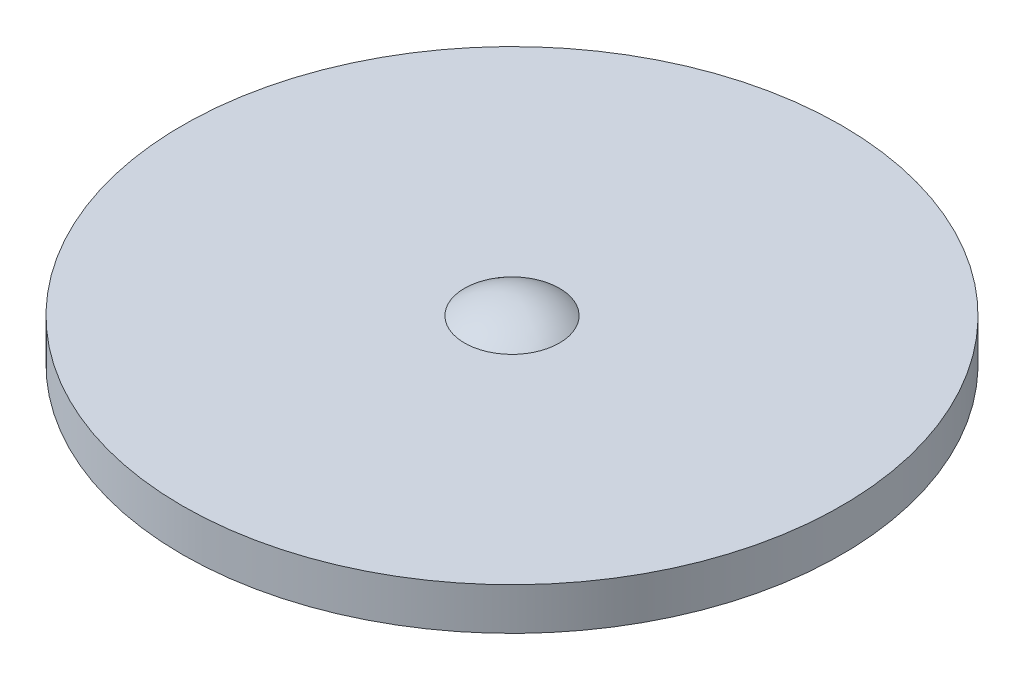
ISO-10303-21;
HEADER;
FILE_DESCRIPTION(('STEP AP214'),'2;1');
FILE_NAME('part.step','',(''),(''),'','','');
FILE_SCHEMA(('AUTOMOTIVE_DESIGN { 1 0 10303 214 1 1 1 1 }'));
ENDSEC;
DATA;
#1=APPLICATION_CONTEXT('core data for automotive mechanical design processes');
#2=APPLICATION_PROTOCOL_DEFINITION('international standard','automotive_design',2000,#1);
#3=PRODUCT_CONTEXT('',#1,'mechanical');
#4=PRODUCT('Part','Part','',(#3));
#5=PRODUCT_RELATED_PRODUCT_CATEGORY('part','',(#4));
#6=PRODUCT_DEFINITION_FORMATION('','',#4);
#7=PRODUCT_DEFINITION_CONTEXT('part definition',#1,'design');
#8=PRODUCT_DEFINITION('design','',#6,#7);
#9=PRODUCT_DEFINITION_SHAPE('','',#8);
#10=(LENGTH_UNIT() NAMED_UNIT(*) SI_UNIT(.MILLI.,.METRE.));
#11=(NAMED_UNIT(*) PLANE_ANGLE_UNIT() SI_UNIT($,.RADIAN.));
#12=(NAMED_UNIT(*) SI_UNIT($,.STERADIAN.) SOLID_ANGLE_UNIT());
#13=UNCERTAINTY_MEASURE_WITH_UNIT(LENGTH_MEASURE(1.E-05),#10,'distance_accuracy_value','');
#14=(GEOMETRIC_REPRESENTATION_CONTEXT(3) GLOBAL_UNCERTAINTY_ASSIGNED_CONTEXT((#13)) GLOBAL_UNIT_ASSIGNED_CONTEXT((#10,
#11,#12)) REPRESENTATION_CONTEXT('',''));
#15=CARTESIAN_POINT('',(0.,0.,0.));
#16=DIRECTION('',(0.,0.,1.));
#17=DIRECTION('',(1.,0.,0.));
#18=AXIS2_PLACEMENT_3D('',#15,#16,#17);
#19=CARTESIAN_POINT('',(0.,-3.048,0.));
#20=DIRECTION('',(-1.,0.,0.));
#21=DIRECTION('',(0.,-1.,0.));
#22=AXIS2_PLACEMENT_3D('',#19,#20,#21);
#23=SPHERICAL_SURFACE('',#22,3.81);
#24=CARTESIAN_POINT('',(-2.286,0.,0.));
#25=CARTESIAN_POINT('',(-2.28599961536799,0.,0.0641837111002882));
#26=CARTESIAN_POINT('',(-2.28329446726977,0.,0.128379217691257));
#27=CARTESIAN_POINT('',(-2.27249146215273,0.,0.256326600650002));
#28=CARTESIAN_POINT('',(-2.26439201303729,0.,0.320078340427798));
#29=CARTESIAN_POINT('',(-2.24283684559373,0.,0.446780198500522));
#30=CARTESIAN_POINT('',(-2.22937262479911,3.36263498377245E-13,0.509728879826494));
#31=CARTESIAN_POINT('',(-2.19718072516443,-3.3653694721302E-13,0.634303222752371));
#32=CARTESIAN_POINT('',(-2.17844877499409,-1.25661374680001E-12,0.695927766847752));
#33=CARTESIAN_POINT('',(-2.11461030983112,-2.25740404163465E-12,0.877891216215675));
#34=CARTESIAN_POINT('',(-2.06180874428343,-5.9142946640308E-13,0.995626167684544));
#35=CARTESIAN_POINT('',(-1.93716104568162,5.9145195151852E-13,1.22054725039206));
#36=CARTESIAN_POINT('',(-1.86531418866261,1.08277087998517E-13,1.32773298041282));
#37=CARTESIAN_POINT('',(-1.74489560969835,0.,1.47827088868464));
#38=CARTESIAN_POINT('',(-1.70261624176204,0.,1.52677176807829));
#39=CARTESIAN_POINT('',(-1.61415533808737,0.,1.62000599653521));
#40=CARTESIAN_POINT('',(-1.56797760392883,0.,1.6647429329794));
#41=CARTESIAN_POINT('',(-1.4719954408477,0.,1.75018721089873));
#42=CARTESIAN_POINT('',(-1.42218937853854,0.,1.79089271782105));
#43=CARTESIAN_POINT('',(-1.31932972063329,0.,1.86796735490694));
#44=CARTESIAN_POINT('',(-1.26627537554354,0.,1.904335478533));
#45=CARTESIAN_POINT('',(-1.10281841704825,0.,2.00650360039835));
#46=CARTESIAN_POINT('',(-0.988020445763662,0.,2.06545748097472));
#47=CARTESIAN_POINT('',(-0.750218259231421,0.,2.16321964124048));
#48=CARTESIAN_POINT('',(-0.627214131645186,-1.39268676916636E-13,2.202028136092));
#49=CARTESIAN_POINT('',(-0.376420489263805,-1.29613436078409E-13,2.25845407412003));
#50=CARTESIAN_POINT('',(-0.248630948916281,0.,2.27607140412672));
#51=CARTESIAN_POINT('',(0.00809187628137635,0.,2.28959666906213));
#52=CARTESIAN_POINT('',(0.13702516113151,0.,2.28550460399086));
#53=CARTESIAN_POINT('',(0.392359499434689,0.,2.25574366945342));
#54=CARTESIAN_POINT('',(0.518760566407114,0.,2.23007491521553));
#55=CARTESIAN_POINT('',(0.765518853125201,0.,2.15784148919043));
#56=CARTESIAN_POINT('',(0.885876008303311,0.,2.111276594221));
#57=CARTESIAN_POINT('',(1.05916360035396,0.,2.02684962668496));
#58=CARTESIAN_POINT('',(1.11574569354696,0.,1.99625762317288));
#59=CARTESIAN_POINT('',(1.22613469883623,0.,1.93041784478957));
#60=CARTESIAN_POINT('',(1.27994225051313,0.,1.89517114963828));
#61=CARTESIAN_POINT('',(1.38437129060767,0.,1.82028539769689));
#62=CARTESIAN_POINT('',(1.43499421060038,0.,1.780648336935));
#63=CARTESIAN_POINT('',(1.53276217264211,0.,1.69722544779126));
#64=CARTESIAN_POINT('',(1.57990381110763,0.,1.65343565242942));
#65=CARTESIAN_POINT('',(1.71547383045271,-1.15217019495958E-13,1.51638432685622));
#66=CARTESIAN_POINT('',(1.79818570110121,0.,1.41734141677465));
#67=CARTESIAN_POINT('',(1.94577738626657,0.,1.20676307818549));
#68=CARTESIAN_POINT('',(2.01065787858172,0.,1.09522812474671));
#69=CARTESIAN_POINT('',(2.09326310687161,0.,0.920979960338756));
#70=CARTESIAN_POINT('',(2.11836667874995,0.,0.861664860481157));
#71=CARTESIAN_POINT('',(2.16347026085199,0.,0.741162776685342));
#72=CARTESIAN_POINT('',(2.18347440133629,0.,0.679977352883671));
#73=CARTESIAN_POINT('',(2.21822368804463,0.,0.556241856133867));
#74=CARTESIAN_POINT('',(2.23297713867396,0.,0.493694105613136));
#75=CARTESIAN_POINT('',(2.25716466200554,0.,0.367590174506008));
#76=CARTESIAN_POINT('',(2.26660030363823,0.,0.304034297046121));
#77=CARTESIAN_POINT('',(2.27755994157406,0.,0.200316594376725));
#78=CARTESIAN_POINT('',(2.28072396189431,0.,0.160320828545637));
#79=CARTESIAN_POINT('',(2.28494411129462,0.,0.0802182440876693));
#80=CARTESIAN_POINT('',(2.28600024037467,0.,0.0401114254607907));
#81=CARTESIAN_POINT('',(2.28599961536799,0.,-0.0641837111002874));
#82=CARTESIAN_POINT('',(2.28329446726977,0.,-0.128379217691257));
#83=CARTESIAN_POINT('',(2.27249146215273,0.,-0.256326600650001));
#84=CARTESIAN_POINT('',(2.26439201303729,0.,-0.320078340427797));
#85=CARTESIAN_POINT('',(2.24283684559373,0.,-0.446780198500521));
#86=CARTESIAN_POINT('',(2.22937262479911,3.3628699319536E-13,-0.509728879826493));
#87=CARTESIAN_POINT('',(2.19718072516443,-3.36560461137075E-13,-0.63430322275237));
#88=CARTESIAN_POINT('',(2.17844877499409,-1.25662193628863E-12,-0.695927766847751));
#89=CARTESIAN_POINT('',(2.11461030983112,-2.25738770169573E-12,-0.877891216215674));
#90=CARTESIAN_POINT('',(2.06180874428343,-5.91425190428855E-13,-0.995626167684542));
#91=CARTESIAN_POINT('',(1.93716104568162,5.91447675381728E-13,-1.22054725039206));
#92=CARTESIAN_POINT('',(1.86531418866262,1.08276324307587E-13,-1.32773298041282));
#93=CARTESIAN_POINT('',(1.74489560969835,0.,-1.47827088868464));
#94=CARTESIAN_POINT('',(1.70261624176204,0.,-1.52677176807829));
#95=CARTESIAN_POINT('',(1.61415533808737,0.,-1.62000599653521));
#96=CARTESIAN_POINT('',(1.56797760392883,0.,-1.6647429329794));
#97=CARTESIAN_POINT('',(1.4719954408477,0.,-1.75018721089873));
#98=CARTESIAN_POINT('',(1.42218937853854,0.,-1.79089271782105));
#99=CARTESIAN_POINT('',(1.3193297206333,0.,-1.86796735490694));
#100=CARTESIAN_POINT('',(1.26627537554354,0.,-1.904335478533));
#101=CARTESIAN_POINT('',(1.10281841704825,0.,-2.00650360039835));
#102=CARTESIAN_POINT('',(0.988020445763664,0.,-2.06545748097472));
#103=CARTESIAN_POINT('',(0.750218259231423,0.,-2.16321964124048));
#104=CARTESIAN_POINT('',(0.627214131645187,-1.39206406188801E-13,-2.202028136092));
#105=CARTESIAN_POINT('',(0.376420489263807,-1.29675707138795E-13,-2.25845407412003));
#106=CARTESIAN_POINT('',(0.248630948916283,0.,-2.27607140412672));
#107=CARTESIAN_POINT('',(-0.00809187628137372,0.,-2.28959666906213));
#108=CARTESIAN_POINT('',(-0.137025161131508,0.,-2.28550460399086));
#109=CARTESIAN_POINT('',(-0.392359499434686,0.,-2.25574366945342));
#110=CARTESIAN_POINT('',(-0.518760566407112,0.,-2.23007491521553));
#111=CARTESIAN_POINT('',(-0.765518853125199,0.,-2.15784148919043));
#112=CARTESIAN_POINT('',(-0.885876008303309,0.,-2.11127659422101));
#113=CARTESIAN_POINT('',(-1.05916360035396,0.,-2.02684962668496));
#114=CARTESIAN_POINT('',(-1.11574569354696,0.,-1.99625762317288));
#115=CARTESIAN_POINT('',(-1.22613469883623,0.,-1.93041784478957));
#116=CARTESIAN_POINT('',(-1.27994225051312,0.,-1.89517114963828));
#117=CARTESIAN_POINT('',(-1.38437129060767,0.,-1.82028539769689));
#118=CARTESIAN_POINT('',(-1.43499421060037,0.,-1.780648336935));
#119=CARTESIAN_POINT('',(-1.53276217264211,0.,-1.69722544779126));
#120=CARTESIAN_POINT('',(-1.57990381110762,0.,-1.65343565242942));
#121=CARTESIAN_POINT('',(-1.71547383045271,-1.15156881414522E-13,-1.51638432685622));
#122=CARTESIAN_POINT('',(-1.79818570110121,0.,-1.41734141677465));
#123=CARTESIAN_POINT('',(-1.94577738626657,0.,-1.20676307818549));
#124=CARTESIAN_POINT('',(-2.01065787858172,0.,-1.09522812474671));
#125=CARTESIAN_POINT('',(-2.09326310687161,0.,-0.920979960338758));
#126=CARTESIAN_POINT('',(-2.11836667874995,0.,-0.861664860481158));
#127=CARTESIAN_POINT('',(-2.16347026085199,0.,-0.741162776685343));
#128=CARTESIAN_POINT('',(-2.18347440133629,0.,-0.679977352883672));
#129=CARTESIAN_POINT('',(-2.21822368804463,0.,-0.556241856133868));
#130=CARTESIAN_POINT('',(-2.23297713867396,0.,-0.493694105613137));
#131=CARTESIAN_POINT('',(-2.25716466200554,0.,-0.36759017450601));
#132=CARTESIAN_POINT('',(-2.26660030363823,0.,-0.304034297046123));
#133=CARTESIAN_POINT('',(-2.27755994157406,0.,-0.200316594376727));
#134=CARTESIAN_POINT('',(-2.28072396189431,0.,-0.160320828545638));
#135=CARTESIAN_POINT('',(-2.28494411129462,0.,-0.0802182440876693));
#136=CARTESIAN_POINT('',(-2.28600024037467,0.,-0.0401114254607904));
#137=CARTESIAN_POINT('',(-2.286,0.,0.));
#138=B_SPLINE_CURVE_WITH_KNOTS('',3,(#24,#25,#26,#27,#28,#29,#30,#31,#32,#33,#34,#35,#36,#37,
#38,#39,#40,#41,#42,#43,#44,#45,#46,#47,#48,#49,#50,#51,#52,#53,#54,#55,#56,#57,#58,#59,#60,#61,
#62,#63,#64,#65,#66,#67,#68,#69,#70,#71,#72,#73,#74,#75,#76,#77,#78,#79,#80,#81,#82,#83,#84,#85,
#86,#87,#88,#89,#90,#91,#92,#93,#94,#95,#96,#97,#98,#99,#100,#101,#102,#103,#104,#105,#106,#107,
#108,#109,#110,#111,#112,#113,#114,#115,#116,#117,#118,#119,#120,#121,#122,#123,#124,#125,#126,
#127,#128,#129,#130,#131,#132,#133,#134,#135,#136,#137),.UNSPECIFIED.,.T.,.F.,(4,2,2,2,2,2,2,2,
2,2,2,2,2,2,2,2,2,2,2,2,2,2,2,2,2,2,2,2,2,2,2,2,2,2,2,2,2,2,2,2,2,2,2,2,2,2,2,2,2,2,2,2,2,2,2,2,
4),(0.,0.192514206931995,0.385085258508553,0.577962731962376,0.770997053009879,1.1561455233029,
1.54130863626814,1.73414254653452,1.92679053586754,2.11952579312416,2.31230569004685,
2.6974635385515,3.08261727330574,3.46777306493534,3.85292885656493,4.23808259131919,
4.62324043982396,4.81602033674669,5.00875559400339,5.20140358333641,5.39423749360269,
5.77940060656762,6.16454907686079,6.35758339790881,6.55046087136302,6.74303192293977,
6.93554612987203,7.05585732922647,7.17616852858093,7.36868273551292,7.56125378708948,
7.75413126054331,7.94716558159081,8.33231405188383,8.71747716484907,8.91031107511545,
9.10295906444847,9.29569432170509,9.48847421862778,9.87363206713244,10.2587858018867,
10.6439415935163,11.0290973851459,11.4142511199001,11.7994089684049,11.9921888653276,
12.1849241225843,12.3775721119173,12.5704060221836,12.9555691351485,13.3407176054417,
13.5337519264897,13.726629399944,13.9192004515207,14.111714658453,14.2320258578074,
14.3523370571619),.UNSPECIFIED.);
#139=CARTESIAN_POINT('',(-2.286,0.,0.));
#140=VERTEX_POINT('',#139);
#141=EDGE_CURVE('E21',#140,#140,#138,.T.);
#142=ORIENTED_EDGE('',*,*,#141,.T.);
#143=EDGE_LOOP('',(#142));
#144=FACE_BOUND('',#143,.T.);
#145=ADVANCED_FACE('F16',(#144),#23,.T.);
#146=CARTESIAN_POINT('',(-15.875,0.,0.));
#147=DIRECTION('',(0.,-1.,0.));
#148=DIRECTION('',(0.,0.,-1.));
#149=AXIS2_PLACEMENT_3D('',#146,#147,#148);
#150=PLANE('',#149);
#151=CARTESIAN_POINT('',(0.,0.,0.));
#152=DIRECTION('',(0.,1.,0.));
#153=DIRECTION('',(0.,0.,1.));
#154=AXIS2_PLACEMENT_3D('',#151,#152,#153);
#155=CIRCLE('',#154,15.875);
#156=CARTESIAN_POINT('',(0.,0.,15.875));
#157=VERTEX_POINT('',#156);
#158=EDGE_CURVE('E33',#157,#157,#155,.F.);
#159=ORIENTED_EDGE('',*,*,#158,.F.);
#160=EDGE_LOOP('',(#159));
#161=FACE_BOUND('',#160,.T.);
#162=ORIENTED_EDGE('',*,*,#141,.F.);
#163=EDGE_LOOP('',(#162));
#164=FACE_BOUND('',#163,.T.);
#165=ADVANCED_FACE('F55',(#161,#164),#150,.F.);
#166=CARTESIAN_POINT('',(0.,-3.048,0.));
#167=DIRECTION('',(-1.,0.,0.));
#168=DIRECTION('',(0.,-1.,0.));
#169=AXIS2_PLACEMENT_3D('',#166,#167,#168);
#170=SPHERICAL_SURFACE('',#169,1.778);
#171=CARTESIAN_POINT('',(-1.45911891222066,-2.032,0.));
#172=CARTESIAN_POINT('',(-1.45911427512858,-2.032,0.0818983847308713));
#173=CARTESIAN_POINT('',(-1.45218569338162,-2.032,0.163942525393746));
#174=CARTESIAN_POINT('',(-1.4315688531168,-2.032,0.285192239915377));
#175=CARTESIAN_POINT('',(-1.42297460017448,-2.032,0.32535744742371));
#176=CARTESIAN_POINT('',(-1.40242684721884,-2.032,0.404860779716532));
#177=CARTESIAN_POINT('',(-1.39047062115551,-2.032,0.444198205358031));
#178=CARTESIAN_POINT('',(-1.34972345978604,-2.032,0.56034829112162));
#179=CARTESIAN_POINT('',(-1.31602057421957,-2.032,0.635494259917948));
#180=CARTESIAN_POINT('',(-1.2364608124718,-2.032,0.779055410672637));
#181=CARTESIAN_POINT('',(-1.19060347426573,-2.032,0.847470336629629));
#182=CARTESIAN_POINT('',(-1.11373928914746,-2.032,0.943558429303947));
#183=CARTESIAN_POINT('',(-1.08675123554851,-2.032,0.974516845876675));
#184=CARTESIAN_POINT('',(-1.03029344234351,-2.032,1.03402337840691));
#185=CARTESIAN_POINT('',(-1.00082612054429,-2.03199999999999,1.06257378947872));
#186=CARTESIAN_POINT('',(-0.908940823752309,-2.03200000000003,1.14436309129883));
#187=CARTESIAN_POINT('',(-0.843022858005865,-2.03200000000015,1.19376083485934));
#188=CARTESIAN_POINT('',(-0.703865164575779,-2.03200000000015,1.28075920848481));
#189=CARTESIAN_POINT('',(-0.630625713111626,-2.03200000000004,1.31836028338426));
#190=CARTESIAN_POINT('',(-0.478865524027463,-2.03199999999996,1.38073978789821));
#191=CARTESIAN_POINT('',(-0.400344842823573,-2.03199999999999,1.40551835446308));
#192=CARTESIAN_POINT('',(-0.240259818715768,-2.03200000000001,1.44153936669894));
#193=CARTESIAN_POINT('',(-0.158695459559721,-2.032,1.45278174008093));
#194=CARTESIAN_POINT('',(0.0051630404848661,-2.032,1.4614145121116));
#195=CARTESIAN_POINT('',(0.087457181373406,-2.032,1.45880491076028));
#196=CARTESIAN_POINT('',(0.250440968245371,-2.032,1.4398045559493));
#197=CARTESIAN_POINT('',(0.331130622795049,-2.032,1.4234138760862));
#198=CARTESIAN_POINT('',(0.488605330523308,-2.032,1.37732619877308));
#199=CARTESIAN_POINT('',(0.565390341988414,-2.032,1.3476290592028));
#200=CARTESIAN_POINT('',(0.712919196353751,-2.032,1.27573456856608));
#201=CARTESIAN_POINT('',(0.783662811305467,-2.032,1.23353674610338));
#202=CARTESIAN_POINT('',(0.883633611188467,-2.032,1.16185525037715));
#203=CARTESIAN_POINT('',(0.915937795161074,-2.032,1.13655922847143));
#204=CARTESIAN_POINT('',(0.978335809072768,-2.032,1.08331453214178));
#205=CARTESIAN_POINT('',(1.00842747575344,-2.032,1.05536332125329));
#206=CARTESIAN_POINT('',(1.09496279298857,-2.032,0.967883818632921));
#207=CARTESIAN_POINT('',(1.1477551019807,-2.032,0.904666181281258));
#208=CARTESIAN_POINT('',(1.24195939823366,-2.032,0.770259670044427));
#209=CARTESIAN_POINT('',(1.2833718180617,-2.032,0.699071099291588));
#210=CARTESIAN_POINT('',(1.33609810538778,-2.032,0.587845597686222));
#211=CARTESIAN_POINT('',(1.35212160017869,-2.032,0.549982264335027));
#212=CARTESIAN_POINT('',(1.38090957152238,-2.032,0.473078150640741));
#213=CARTESIAN_POINT('',(1.39367668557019,-2.032,0.434038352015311));
#214=CARTESIAN_POINT('',(1.42691994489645,-2.032,0.315626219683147));
#215=CARTESIAN_POINT('',(1.44243111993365,-2.032,0.234764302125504));
#216=CARTESIAN_POINT('',(1.45373383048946,-2.032,0.127851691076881));
#217=CARTESIAN_POINT('',(1.45575149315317,-2.032,0.102326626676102));
#218=CARTESIAN_POINT('',(1.45844475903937,-2.032,0.0512057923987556));
#219=CARTESIAN_POINT('',(1.45912036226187,-2.032,0.0256100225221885));
#220=CARTESIAN_POINT('',(1.45911427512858,-2.032,-0.0818983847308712));
#221=CARTESIAN_POINT('',(1.45218569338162,-2.032,-0.163942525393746));
#222=CARTESIAN_POINT('',(1.4315688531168,-2.032,-0.285192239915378));
#223=CARTESIAN_POINT('',(1.42297460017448,-2.032,-0.32535744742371));
#224=CARTESIAN_POINT('',(1.40242684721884,-2.032,-0.404860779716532));
#225=CARTESIAN_POINT('',(1.39047062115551,-2.032,-0.444198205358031));
#226=CARTESIAN_POINT('',(1.34972345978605,-2.032,-0.560348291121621));
#227=CARTESIAN_POINT('',(1.31602057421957,-2.032,-0.635494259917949));
#228=CARTESIAN_POINT('',(1.2364608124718,-2.032,-0.779055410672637));
#229=CARTESIAN_POINT('',(1.19060347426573,-2.032,-0.84747033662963));
#230=CARTESIAN_POINT('',(1.11373928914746,-2.032,-0.943558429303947));
#231=CARTESIAN_POINT('',(1.08675123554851,-2.032,-0.974516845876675));
#232=CARTESIAN_POINT('',(1.03029344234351,-2.032,-1.03402337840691));
#233=CARTESIAN_POINT('',(1.00082612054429,-2.03199999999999,-1.06257378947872));
#234=CARTESIAN_POINT('',(0.90894082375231,-2.03200000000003,-1.14436309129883));
#235=CARTESIAN_POINT('',(0.843022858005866,-2.03200000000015,-1.19376083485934));
#236=CARTESIAN_POINT('',(0.703865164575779,-2.03200000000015,-1.28075920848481));
#237=CARTESIAN_POINT('',(0.630625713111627,-2.03200000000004,-1.31836028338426));
#238=CARTESIAN_POINT('',(0.478865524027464,-2.03199999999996,-1.38073978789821));
#239=CARTESIAN_POINT('',(0.400344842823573,-2.03199999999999,-1.40551835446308));
#240=CARTESIAN_POINT('',(0.240259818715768,-2.03200000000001,-1.44153936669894));
#241=CARTESIAN_POINT('',(0.158695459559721,-2.032,-1.45278174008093));
#242=CARTESIAN_POINT('',(-0.00516304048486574,-2.032,-1.4614145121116));
#243=CARTESIAN_POINT('',(-0.0874571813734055,-2.032,-1.45880491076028));
#244=CARTESIAN_POINT('',(-0.25044096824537,-2.032,-1.4398045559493));
#245=CARTESIAN_POINT('',(-0.331130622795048,-2.032,-1.4234138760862));
#246=CARTESIAN_POINT('',(-0.488605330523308,-2.032,-1.37732619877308));
#247=CARTESIAN_POINT('',(-0.565390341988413,-2.032,-1.3476290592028));
#248=CARTESIAN_POINT('',(-0.71291919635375,-2.032,-1.27573456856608));
#249=CARTESIAN_POINT('',(-0.783662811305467,-2.032,-1.23353674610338));
#250=CARTESIAN_POINT('',(-0.883633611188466,-2.032,-1.16185525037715));
#251=CARTESIAN_POINT('',(-0.915937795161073,-2.032,-1.13655922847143));
#252=CARTESIAN_POINT('',(-0.978335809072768,-2.032,-1.08331453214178));
#253=CARTESIAN_POINT('',(-1.00842747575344,-2.032,-1.05536332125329));
#254=CARTESIAN_POINT('',(-1.09496279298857,-2.032,-0.967883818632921));
#255=CARTESIAN_POINT('',(-1.1477551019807,-2.032,-0.904666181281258));
#256=CARTESIAN_POINT('',(-1.24195939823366,-2.032,-0.770259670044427));
#257=CARTESIAN_POINT('',(-1.2833718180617,-2.032,-0.699071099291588));
#258=CARTESIAN_POINT('',(-1.33609810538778,-2.032,-0.587845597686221));
#259=CARTESIAN_POINT('',(-1.35212160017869,-2.032,-0.549982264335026));
#260=CARTESIAN_POINT('',(-1.38090957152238,-2.032,-0.473078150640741));
#261=CARTESIAN_POINT('',(-1.39367668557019,-2.032,-0.434038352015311));
#262=CARTESIAN_POINT('',(-1.42691994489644,-2.032,-0.315626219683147));
#263=CARTESIAN_POINT('',(-1.44243111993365,-2.032,-0.234764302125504));
#264=CARTESIAN_POINT('',(-1.45373383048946,-2.032,-0.127851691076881));
#265=CARTESIAN_POINT('',(-1.45575149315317,-2.032,-0.102326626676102));
#266=CARTESIAN_POINT('',(-1.45844475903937,-2.032,-0.0512057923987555));
#267=CARTESIAN_POINT('',(-1.45912036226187,-2.032,-0.0256100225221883));
#268=CARTESIAN_POINT('',(-1.45911891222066,-2.032,0.));
#269=B_SPLINE_CURVE_WITH_KNOTS('',3,(#171,#172,#173,#174,#175,#176,#177,#178,#179,#180,#181,
#182,#183,#184,#185,#186,#187,#188,#189,#190,#191,#192,#193,#194,#195,#196,#197,#198,#199,#200,
#201,#202,#203,#204,#205,#206,#207,#208,#209,#210,#211,#212,#213,#214,#215,#216,#217,#218,#219,
#220,#221,#222,#223,#224,#225,#226,#227,#228,#229,#230,#231,#232,#233,#234,#235,#236,#237,#238,
#239,#240,#241,#242,#243,#244,#245,#246,#247,#248,#249,#250,#251,#252,#253,#254,#255,#256,#257,
#258,#259,#260,#261,#262,#263,#264,#265,#266,#267,#268),.UNSPECIFIED.,.T.,.F.,(4,2,2,2,2,2,2,2,
2,2,2,2,2,2,2,2,2,2,2,2,2,2,2,2,2,2,2,2,2,2,2,2,2,2,2,2,2,2,2,2,2,2,2,2,2,2,2,2,4),(0.,
0.24557598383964,0.368686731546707,0.491897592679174,0.737731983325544,0.983575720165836,
1.1066586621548,1.22962293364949,1.47547258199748,1.72131295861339,1.96715070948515,
2.2129897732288,2.45882883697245,2.70466658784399,2.9505069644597,3.1963566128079,
3.31932088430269,3.44240382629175,3.68824756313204,3.93408195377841,4.05729281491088,
4.18040356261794,4.42597954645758,4.5027723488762,4.57956515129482,4.82514113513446,
4.94825188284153,5.07146274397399,5.31729713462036,5.56314087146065,5.68622381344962,
5.80918808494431,6.0550377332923,6.30087810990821,6.54671586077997,6.79255492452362,
7.03839398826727,7.28423173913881,7.53007211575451,7.77592176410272,7.8988860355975,
8.02196897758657,8.26781271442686,8.51364710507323,8.6368579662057,8.75996871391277,
9.0055446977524,9.08233750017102,9.15913030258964),.UNSPECIFIED.);
#270=CARTESIAN_POINT('',(-1.45911891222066,-2.032,0.));
#271=VERTEX_POINT('',#270);
#272=EDGE_CURVE('E28',#271,#271,#269,.T.);
#273=ORIENTED_EDGE('',*,*,#272,.F.);
#274=EDGE_LOOP('',(#273));
#275=FACE_BOUND('',#274,.T.);
#276=ADVANCED_FACE('F42',(#275),#170,.F.);
#277=CARTESIAN_POINT('',(0.,0.,0.));
#278=DIRECTION('',(0.,1.,0.));
#279=DIRECTION('',(0.,0.,1.));
#280=AXIS2_PLACEMENT_3D('',#277,#278,#279);
#281=CYLINDRICAL_SURFACE('',#280,15.875);
#282=CARTESIAN_POINT('',(0.,-2.032,0.));
#283=DIRECTION('',(0.,1.,0.));
#284=DIRECTION('',(0.,0.,1.));
#285=AXIS2_PLACEMENT_3D('',#282,#283,#284);
#286=CIRCLE('',#285,15.875);
#287=CARTESIAN_POINT('',(0.,-2.032,15.875));
#288=VERTEX_POINT('',#287);
#289=EDGE_CURVE('E10',#288,#288,#286,.F.);
#290=ORIENTED_EDGE('',*,*,#289,.F.);
#291=EDGE_LOOP('',(#290));
#292=FACE_BOUND('',#291,.T.);
#293=ORIENTED_EDGE('',*,*,#158,.T.);
#294=EDGE_LOOP('',(#293));
#295=FACE_BOUND('',#294,.T.);
#296=ADVANCED_FACE('F48',(#292,#295),#281,.T.);
#297=CARTESIAN_POINT('',(-15.875,-2.032,0.));
#298=DIRECTION('',(0.,-1.,0.));
#299=DIRECTION('',(0.,0.,-1.));
#300=AXIS2_PLACEMENT_3D('',#297,#298,#299);
#301=PLANE('',#300);
#302=ORIENTED_EDGE('',*,*,#289,.T.);
#303=EDGE_LOOP('',(#302));
#304=FACE_BOUND('',#303,.T.);
#305=ORIENTED_EDGE('',*,*,#272,.T.);
#306=EDGE_LOOP('',(#305));
#307=FACE_BOUND('',#306,.T.);
#308=ADVANCED_FACE('F45',(#304,#307),#301,.T.);
#309=CLOSED_SHELL('',(#145,#165,#276,#296,#308));
#310=MANIFOLD_SOLID_BREP('B1',#309);
#311=ADVANCED_BREP_SHAPE_REPRESENTATION('',(#18,#310),#14);
#312=SHAPE_DEFINITION_REPRESENTATION(#9,#311);
ENDSEC;
END-ISO-10303-21;
